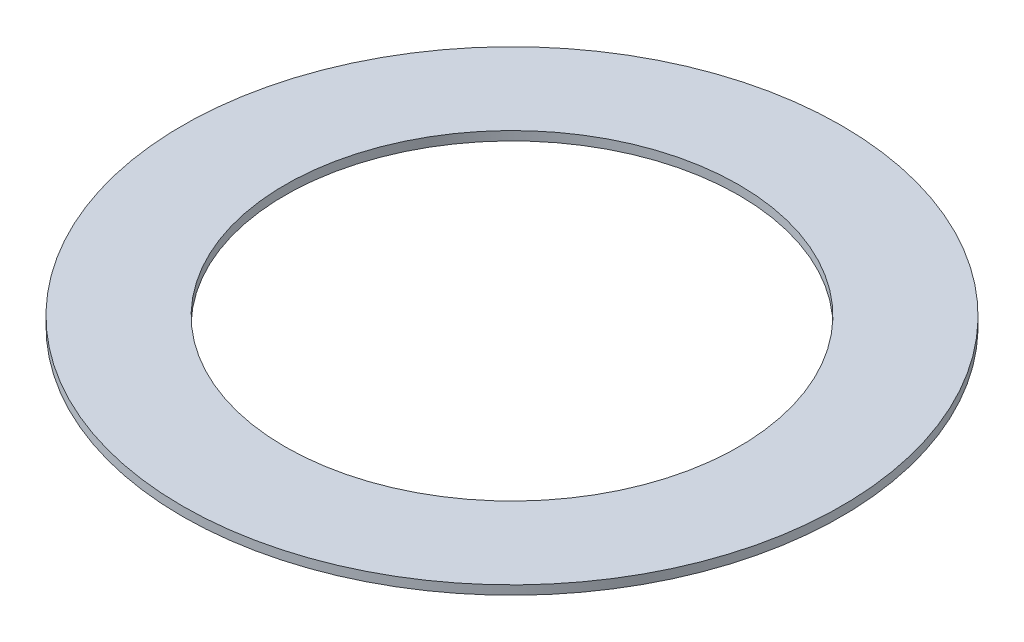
from build123d import *

# Parameters (mm, degrees)
SKETCH1_R      = 4.6482
SKETCH1_R_2    = 3.2004
EXTRUDE1_DEPTH = 0.127


with BuildPart() as part:
    # Sketch1 → Extrude1 (new body)
    with BuildSketch(Plane(origin=(0, 0, 0), x_dir=(1, 0, 0), z_dir=(0, 1, 0))):
        with Locations(Location((0, 0, 0), (0, 0, 270))):
            Circle(SKETCH1_R)
        with Locations(Location((0, 0, 0), (0, 0, 270))):
            Circle(SKETCH1_R_2, mode=Mode.SUBTRACT)
    extrude(amount=EXTRUDE1_DEPTH)


solid = part.part
